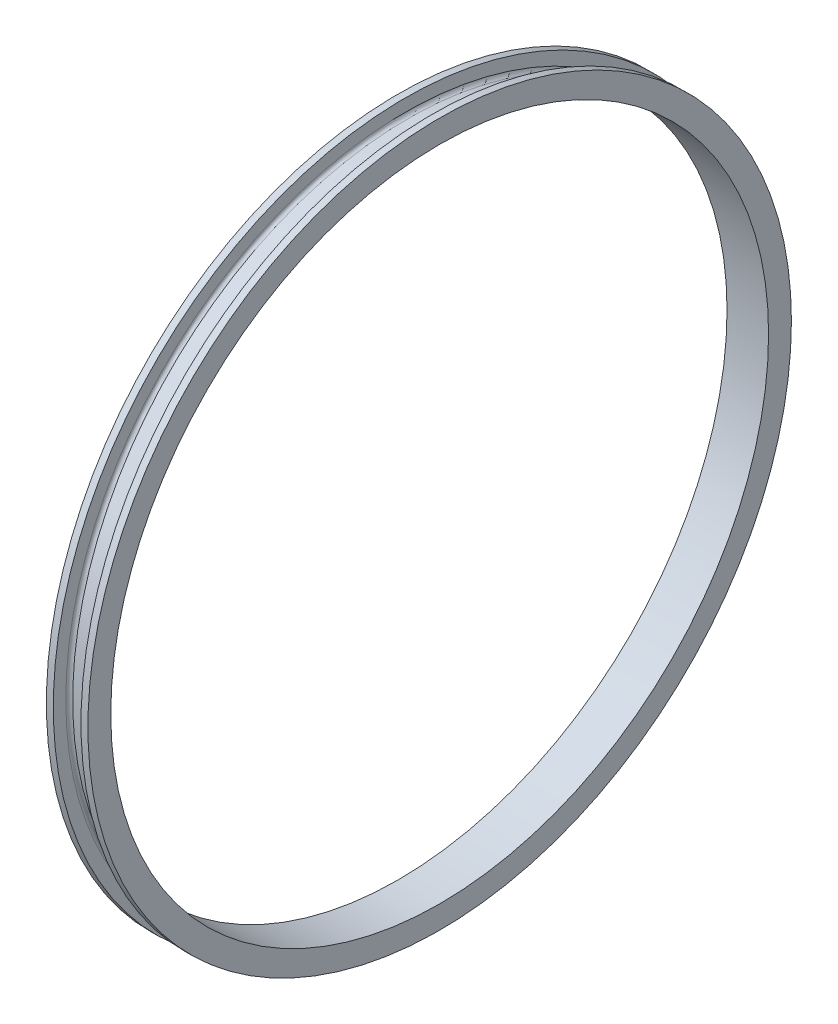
from build123d import *


with BuildPart() as part:
    # Esquisse1 → Base-R_volution (revolve)
    with BuildSketch(Plane.XY, mode=Mode.PRIVATE) as base_r_volution_sk:
        with BuildLine():
            Line((-75.817023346, 50.8), (-75.817023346, 47.5))
            Line((-75.817023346, 47.5), (-69.817023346, 47.5))
            Line((-69.817023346, 47.5), (-69.817023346, 50.8))
            Line((-69.817023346, 50.8), (-70.817023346, 50.8))
            Line((-70.817023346, 50.8), (-70.817023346, 49))
            ThreePointArc((-70.817023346, 49), (-70.963469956, 48.646446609), (-71.317023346, 48.5))
            Line((-71.317023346, 48.5), (-74.317023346, 48.5))
            ThreePointArc((-74.317023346, 48.5), (-74.670576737, 48.646446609), (-74.817023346, 49))
            Line((-74.817023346, 49), (-74.817023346, 50.8))
            Line((-74.817023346, 50.8), (-75.817023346, 50.8))
        make_face()
    revolve(base_r_volution_sk.sketch.rotate(Axis((0, 0, 0), (-1, 0, 0)), 90), axis=Axis((0, 0, 0), (-1, 0, 0)))


solid = part.part
